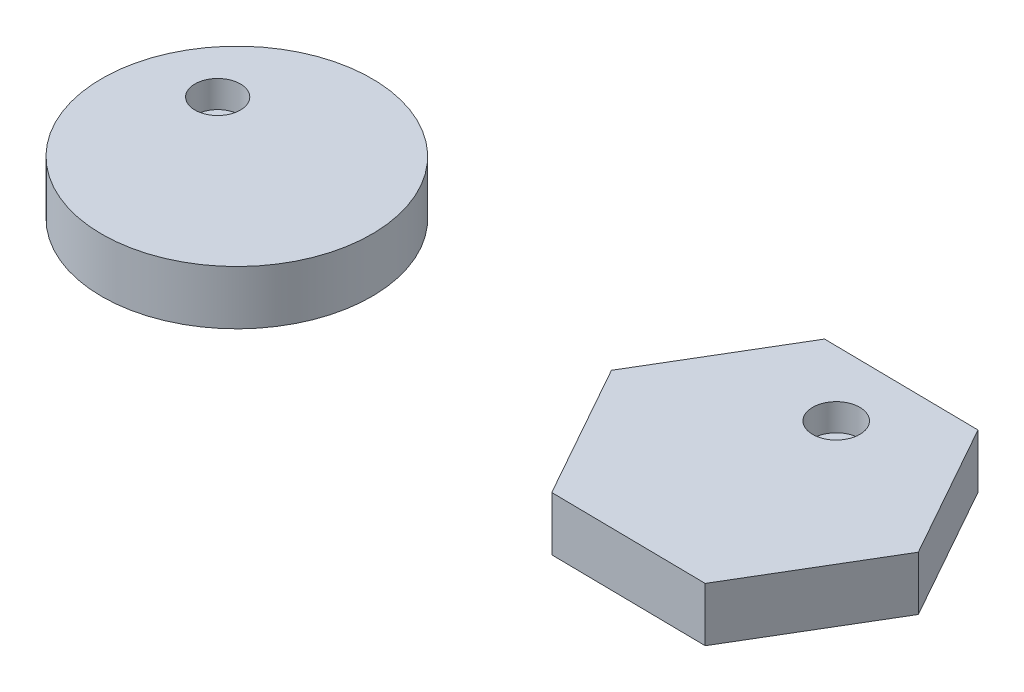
ISO-10303-21;
HEADER;
FILE_DESCRIPTION(('STEP AP214'),'2;1');
FILE_NAME('part.step','',(''),(''),'','','');
FILE_SCHEMA(('AUTOMOTIVE_DESIGN { 1 0 10303 214 1 1 1 1 }'));
ENDSEC;
DATA;
#1=APPLICATION_CONTEXT('core data for automotive mechanical design processes');
#2=APPLICATION_PROTOCOL_DEFINITION('international standard','automotive_design',2000,#1);
#3=PRODUCT_CONTEXT('',#1,'mechanical');
#4=PRODUCT('Part','Part','',(#3));
#5=PRODUCT_RELATED_PRODUCT_CATEGORY('part','',(#4));
#6=PRODUCT_DEFINITION_FORMATION('','',#4);
#7=PRODUCT_DEFINITION_CONTEXT('part definition',#1,'design');
#8=PRODUCT_DEFINITION('design','',#6,#7);
#9=PRODUCT_DEFINITION_SHAPE('','',#8);
#10=(LENGTH_UNIT() NAMED_UNIT(*) SI_UNIT(.MILLI.,.METRE.));
#11=(NAMED_UNIT(*) PLANE_ANGLE_UNIT() SI_UNIT($,.RADIAN.));
#12=(NAMED_UNIT(*) SI_UNIT($,.STERADIAN.) SOLID_ANGLE_UNIT());
#13=UNCERTAINTY_MEASURE_WITH_UNIT(LENGTH_MEASURE(1.E-05),#10,'distance_accuracy_value','');
#14=(GEOMETRIC_REPRESENTATION_CONTEXT(3) GLOBAL_UNCERTAINTY_ASSIGNED_CONTEXT((#13)) GLOBAL_UNIT_ASSIGNED_CONTEXT((#10,
#11,#12)) REPRESENTATION_CONTEXT('',''));
#15=CARTESIAN_POINT('',(0.,0.,0.));
#16=DIRECTION('',(0.,0.,1.));
#17=DIRECTION('',(1.,0.,0.));
#18=AXIS2_PLACEMENT_3D('',#15,#16,#17);
#19=CARTESIAN_POINT('',(321.63135187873,25.4,0.956410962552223));
#20=DIRECTION('',(-0.872487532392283,0.,0.488636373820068));
#21=DIRECTION('',(0.488636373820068,0.,0.872487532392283));
#22=AXIS2_PLACEMENT_3D('',#19,#20,#21);
#23=PLANE('',#22);
#24=DIRECTION('',(-0.488636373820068,0.,-0.872487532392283));
#25=VECTOR('',#24,1.);
#26=CARTESIAN_POINT('',(321.63135187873,0.,0.956410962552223));
#27=LINE('',#26,#25);
#28=CARTESIAN_POINT('',(321.63135187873,0.,0.956410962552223));
#29=VERTEX_POINT('',#28);
#30=CARTESIAN_POINT('',(285.881035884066,0.,-62.8777746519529));
#31=VERTEX_POINT('',#30);
#32=EDGE_CURVE('E123',#29,#31,#27,.T.);
#33=ORIENTED_EDGE('',*,*,#32,.T.);
#34=DIRECTION('',(0.,-1.,0.));
#35=VECTOR('',#34,1.);
#36=CARTESIAN_POINT('',(285.881035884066,25.4,-62.8777746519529));
#37=LINE('',#36,#35);
#38=CARTESIAN_POINT('',(285.881035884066,25.4,-62.8777746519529));
#39=VERTEX_POINT('',#38);
#40=EDGE_CURVE('E12',#39,#31,#37,.T.);
#41=ORIENTED_EDGE('',*,*,#40,.F.);
#42=DIRECTION('',(-0.488636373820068,0.,-0.872487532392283));
#43=VECTOR('',#42,1.);
#44=CARTESIAN_POINT('',(321.63135187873,25.4,0.956410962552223));
#45=LINE('',#44,#43);
#46=CARTESIAN_POINT('',(321.63135187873,25.4,0.956410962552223));
#47=VERTEX_POINT('',#46);
#48=EDGE_CURVE('E134',#47,#39,#45,.T.);
#49=ORIENTED_EDGE('',*,*,#48,.F.);
#50=DIRECTION('',(0.,-1.,0.));
#51=VECTOR('',#50,1.);
#52=CARTESIAN_POINT('',(321.63135187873,25.4,0.956410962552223));
#53=LINE('',#52,#51);
#54=EDGE_CURVE('E119',#47,#29,#53,.T.);
#55=ORIENTED_EDGE('',*,*,#54,.T.);
#56=EDGE_LOOP('',(#33,#41,#49,#55));
#57=FACE_BOUND('',#56,.T.);
#58=ADVANCED_FACE('F39',(#57),#23,.F.);
#59=CARTESIAN_POINT('',(285.881035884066,25.4,-62.8777746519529));
#60=DIRECTION('',(-0.0130722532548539,0.,0.999914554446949));
#61=DIRECTION('',(0.999914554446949,0.,0.0130722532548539));
#62=AXIS2_PLACEMENT_3D('',#59,#60,#61);
#63=PLANE('',#62);
#64=DIRECTION('',(-0.999914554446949,0.,-0.0130722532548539));
#65=VECTOR('',#64,1.);
#66=CARTESIAN_POINT('',(285.881035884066,0.,-62.8777746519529));
#67=LINE('',#66,#65);
#68=CARTESIAN_POINT('',(212.723851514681,0.,-63.8341856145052));
#69=VERTEX_POINT('',#68);
#70=EDGE_CURVE('E126',#31,#69,#67,.T.);
#71=ORIENTED_EDGE('',*,*,#70,.T.);
#72=DIRECTION('',(0.,-1.,0.));
#73=VECTOR('',#72,1.);
#74=CARTESIAN_POINT('',(212.723851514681,25.4,-63.8341856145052));
#75=LINE('',#74,#73);
#76=CARTESIAN_POINT('',(212.723851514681,25.4,-63.8341856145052));
#77=VERTEX_POINT('',#76);
#78=EDGE_CURVE('E47',#77,#69,#75,.T.);
#79=ORIENTED_EDGE('',*,*,#78,.F.);
#80=DIRECTION('',(-0.999914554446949,0.,-0.0130722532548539));
#81=VECTOR('',#80,1.);
#82=CARTESIAN_POINT('',(285.881035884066,25.4,-62.8777746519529));
#83=LINE('',#82,#81);
#84=EDGE_CURVE('E92',#39,#77,#83,.T.);
#85=ORIENTED_EDGE('',*,*,#84,.F.);
#86=ORIENTED_EDGE('',*,*,#40,.T.);
#87=EDGE_LOOP('',(#71,#79,#85,#86));
#88=FACE_BOUND('',#87,.T.);
#89=ADVANCED_FACE('F159',(#88),#63,.F.);
#90=CARTESIAN_POINT('',(212.723851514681,25.4,-63.8341856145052));
#91=DIRECTION('',(0.85941527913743,0.,0.511278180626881));
#92=DIRECTION('',(0.511278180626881,0.,-0.85941527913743));
#93=AXIS2_PLACEMENT_3D('',#90,#91,#92);
#94=PLANE('',#93);
#95=DIRECTION('',(-0.511278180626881,0.,0.85941527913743));
#96=VECTOR('',#95,1.);
#97=CARTESIAN_POINT('',(212.723851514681,0.,-63.8341856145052));
#98=LINE('',#97,#96);
#99=CARTESIAN_POINT('',(175.31698313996,0.,-0.956410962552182));
#100=VERTEX_POINT('',#99);
#101=EDGE_CURVE('E129',#69,#100,#98,.T.);
#102=ORIENTED_EDGE('',*,*,#101,.T.);
#103=DIRECTION('',(0.,-1.,0.));
#104=VECTOR('',#103,1.);
#105=CARTESIAN_POINT('',(175.31698313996,25.4,-0.956410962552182));
#106=LINE('',#105,#104);
#107=CARTESIAN_POINT('',(175.31698313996,25.4,-0.956410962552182));
#108=VERTEX_POINT('',#107);
#109=EDGE_CURVE('E114',#108,#100,#106,.T.);
#110=ORIENTED_EDGE('',*,*,#109,.F.);
#111=DIRECTION('',(-0.511278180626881,0.,0.85941527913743));
#112=VECTOR('',#111,1.);
#113=CARTESIAN_POINT('',(212.723851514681,25.4,-63.8341856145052));
#114=LINE('',#113,#112);
#115=EDGE_CURVE('E105',#77,#108,#114,.T.);
#116=ORIENTED_EDGE('',*,*,#115,.F.);
#117=ORIENTED_EDGE('',*,*,#78,.T.);
#118=EDGE_LOOP('',(#102,#110,#116,#117));
#119=FACE_BOUND('',#118,.T.);
#120=ADVANCED_FACE('F140',(#119),#94,.F.);
#121=CARTESIAN_POINT('',(175.31698313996,25.4,-0.956410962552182));
#122=DIRECTION('',(0.872487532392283,0.,-0.488636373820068));
#123=DIRECTION('',(-0.488636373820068,0.,-0.872487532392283));
#124=AXIS2_PLACEMENT_3D('',#121,#122,#123);
#125=PLANE('',#124);
#126=DIRECTION('',(0.488636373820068,0.,0.872487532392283));
#127=VECTOR('',#126,1.);
#128=CARTESIAN_POINT('',(175.31698313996,0.,-0.956410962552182));
#129=LINE('',#128,#127);
#130=CARTESIAN_POINT('',(211.067299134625,0.,62.877774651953));
#131=VERTEX_POINT('',#130);
#132=EDGE_CURVE('E113',#100,#131,#129,.T.);
#133=ORIENTED_EDGE('',*,*,#132,.T.);
#134=DIRECTION('',(0.,-1.,0.));
#135=VECTOR('',#134,1.);
#136=CARTESIAN_POINT('',(211.067299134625,25.4,62.877774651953));
#137=LINE('',#136,#135);
#138=CARTESIAN_POINT('',(211.067299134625,25.4,62.877774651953));
#139=VERTEX_POINT('',#138);
#140=EDGE_CURVE('E110',#139,#131,#137,.T.);
#141=ORIENTED_EDGE('',*,*,#140,.F.);
#142=DIRECTION('',(0.488636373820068,0.,0.872487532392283));
#143=VECTOR('',#142,1.);
#144=CARTESIAN_POINT('',(175.31698313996,25.4,-0.956410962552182));
#145=LINE('',#144,#143);
#146=EDGE_CURVE('E99',#108,#139,#145,.T.);
#147=ORIENTED_EDGE('',*,*,#146,.F.);
#148=ORIENTED_EDGE('',*,*,#109,.T.);
#149=EDGE_LOOP('',(#133,#141,#147,#148));
#150=FACE_BOUND('',#149,.T.);
#151=ADVANCED_FACE('F111',(#150),#125,.F.);
#152=CARTESIAN_POINT('',(211.067299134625,25.4,62.877774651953));
#153=DIRECTION('',(0.0130722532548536,0.,-0.999914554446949));
#154=DIRECTION('',(-0.999914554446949,0.,-0.0130722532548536));
#155=AXIS2_PLACEMENT_3D('',#152,#153,#154);
#156=PLANE('',#155);
#157=DIRECTION('',(0.999914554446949,0.,0.0130722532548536));
#158=VECTOR('',#157,1.);
#159=CARTESIAN_POINT('',(211.067299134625,0.,62.877774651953));
#160=LINE('',#159,#158);
#161=CARTESIAN_POINT('',(284.224483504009,0.,63.8341856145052));
#162=VERTEX_POINT('',#161);
#163=EDGE_CURVE('E78',#131,#162,#160,.T.);
#164=ORIENTED_EDGE('',*,*,#163,.T.);
#165=DIRECTION('',(0.,-1.,0.));
#166=VECTOR('',#165,1.);
#167=CARTESIAN_POINT('',(284.224483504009,25.4,63.8341856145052));
#168=LINE('',#167,#166);
#169=CARTESIAN_POINT('',(284.224483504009,25.4,63.8341856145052));
#170=VERTEX_POINT('',#169);
#171=EDGE_CURVE('E115',#170,#162,#168,.T.);
#172=ORIENTED_EDGE('',*,*,#171,.F.);
#173=DIRECTION('',(0.999914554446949,0.,0.0130722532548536));
#174=VECTOR('',#173,1.);
#175=CARTESIAN_POINT('',(211.067299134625,25.4,62.877774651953));
#176=LINE('',#175,#174);
#177=EDGE_CURVE('E103',#139,#170,#176,.T.);
#178=ORIENTED_EDGE('',*,*,#177,.F.);
#179=ORIENTED_EDGE('',*,*,#140,.T.);
#180=EDGE_LOOP('',(#164,#172,#178,#179));
#181=FACE_BOUND('',#180,.T.);
#182=ADVANCED_FACE('F117',(#181),#156,.F.);
#183=CARTESIAN_POINT('',(284.224483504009,25.4,63.8341856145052));
#184=DIRECTION('',(-0.85941527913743,0.,-0.511278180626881));
#185=DIRECTION('',(-0.511278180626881,0.,0.85941527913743));
#186=AXIS2_PLACEMENT_3D('',#183,#184,#185);
#187=PLANE('',#186);
#188=DIRECTION('',(0.511278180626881,0.,-0.85941527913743));
#189=VECTOR('',#188,1.);
#190=CARTESIAN_POINT('',(284.224483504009,0.,63.8341856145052));
#191=LINE('',#190,#189);
#192=EDGE_CURVE('E84',#162,#29,#191,.T.);
#193=ORIENTED_EDGE('',*,*,#192,.T.);
#194=ORIENTED_EDGE('',*,*,#54,.F.);
#195=DIRECTION('',(0.511278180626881,0.,-0.85941527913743));
#196=VECTOR('',#195,1.);
#197=CARTESIAN_POINT('',(284.224483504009,25.4,63.8341856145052));
#198=LINE('',#197,#196);
#199=EDGE_CURVE('E55',#170,#47,#198,.T.);
#200=ORIENTED_EDGE('',*,*,#199,.F.);
#201=ORIENTED_EDGE('',*,*,#171,.T.);
#202=EDGE_LOOP('',(#193,#194,#200,#201));
#203=FACE_BOUND('',#202,.T.);
#204=ADVANCED_FACE('F147',(#203),#187,.F.);
#205=CARTESIAN_POINT('',(285.881035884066,25.4,-62.8777746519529));
#206=DIRECTION('',(0.,1.,0.));
#207=DIRECTION('',(0.,0.,1.));
#208=AXIS2_PLACEMENT_3D('',#205,#206,#207);
#209=PLANE('',#208);
#210=CARTESIAN_POINT('',(248.8073716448,25.4,-33.2379084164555));
#211=DIRECTION('',(0.,1.,0.));
#212=DIRECTION('',(0.,0.,1.));
#213=AXIS2_PLACEMENT_3D('',#210,#211,#212);
#214=CIRCLE('',#213,11.0793028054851);
#215=CARTESIAN_POINT('',(248.8073716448,25.4,-22.1586056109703));
#216=VERTEX_POINT('',#215);
#217=EDGE_CURVE('E220',#216,#216,#214,.T.);
#218=ORIENTED_EDGE('',*,*,#217,.F.);
#219=EDGE_LOOP('',(#218));
#220=FACE_BOUND('',#219,.T.);
#221=ORIENTED_EDGE('',*,*,#48,.T.);
#222=ORIENTED_EDGE('',*,*,#84,.T.);
#223=ORIENTED_EDGE('',*,*,#115,.T.);
#224=ORIENTED_EDGE('',*,*,#146,.T.);
#225=ORIENTED_EDGE('',*,*,#177,.T.);
#226=ORIENTED_EDGE('',*,*,#199,.T.);
#227=EDGE_LOOP('',(#221,#222,#223,#224,#225,#226));
#228=FACE_BOUND('',#227,.T.);
#229=ADVANCED_FACE('F101',(#220,#228),#209,.T.);
#230=CARTESIAN_POINT('',(285.881035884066,0.,-62.8777746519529));
#231=DIRECTION('',(0.,1.,0.));
#232=DIRECTION('',(0.,0.,1.));
#233=AXIS2_PLACEMENT_3D('',#230,#231,#232);
#234=PLANE('',#233);
#235=ORIENTED_EDGE('',*,*,#32,.F.);
#236=ORIENTED_EDGE('',*,*,#192,.F.);
#237=ORIENTED_EDGE('',*,*,#163,.F.);
#238=ORIENTED_EDGE('',*,*,#132,.F.);
#239=ORIENTED_EDGE('',*,*,#101,.F.);
#240=ORIENTED_EDGE('',*,*,#70,.F.);
#241=EDGE_LOOP('',(#235,#236,#237,#238,#239,#240));
#242=FACE_BOUND('',#241,.T.);
#243=ADVANCED_FACE('F143',(#242),#234,.F.);
#244=CARTESIAN_POINT('',(248.8073716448,12.7,-33.2379084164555));
#245=DIRECTION('',(0.,1.,0.));
#246=DIRECTION('',(0.,0.,1.));
#247=AXIS2_PLACEMENT_3D('',#244,#245,#246);
#248=CYLINDRICAL_SURFACE('',#247,11.0793028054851);
#249=CARTESIAN_POINT('',(248.8073716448,12.7,-33.2379084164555));
#250=DIRECTION('',(0.,1.,0.));
#251=DIRECTION('',(0.,0.,1.));
#252=AXIS2_PLACEMENT_3D('',#249,#250,#251);
#253=CIRCLE('',#252,11.0793028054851);
#254=CARTESIAN_POINT('',(248.8073716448,12.7,-22.1586056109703));
#255=VERTEX_POINT('',#254);
#256=EDGE_CURVE('E127',#255,#255,#253,.T.);
#257=ORIENTED_EDGE('',*,*,#256,.F.);
#258=EDGE_LOOP('',(#257));
#259=FACE_BOUND('',#258,.T.);
#260=ORIENTED_EDGE('',*,*,#217,.T.);
#261=EDGE_LOOP('',(#260));
#262=FACE_BOUND('',#261,.T.);
#263=ADVANCED_FACE('F191',(#259,#262),#248,.F.);
#264=CARTESIAN_POINT('',(248.8073716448,12.7,-33.2379084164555));
#265=DIRECTION('',(0.,1.,0.));
#266=DIRECTION('',(0.,0.,1.));
#267=AXIS2_PLACEMENT_3D('',#264,#265,#266);
#268=PLANE('',#267);
#269=ORIENTED_EDGE('',*,*,#256,.T.);
#270=EDGE_LOOP('',(#269));
#271=FACE_BOUND('',#270,.T.);
#272=ADVANCED_FACE('F204',(#271),#268,.T.);
#273=CLOSED_SHELL('',(#58,#89,#120,#151,#182,#204,#229,#243,#263,#272));
#274=MANIFOLD_SOLID_BREP('B2',#273);
#275=CARTESIAN_POINT('',(0.,25.4,0.));
#276=DIRECTION('',(0.,-1.,0.));
#277=DIRECTION('',(0.,0.,-1.));
#278=AXIS2_PLACEMENT_3D('',#275,#276,#277);
#279=CYLINDRICAL_SURFACE('',#278,63.5);
#280=CARTESIAN_POINT('',(0.,25.4,0.));
#281=DIRECTION('',(0.,1.,0.));
#282=DIRECTION('',(0.,0.,1.));
#283=AXIS2_PLACEMENT_3D('',#280,#281,#282);
#284=CIRCLE('',#283,63.5);
#285=CARTESIAN_POINT('',(0.,25.4,63.5));
#286=VERTEX_POINT('',#285);
#287=EDGE_CURVE('E38',#286,#286,#284,.T.);
#288=ORIENTED_EDGE('',*,*,#287,.F.);
#289=EDGE_LOOP('',(#288));
#290=FACE_BOUND('',#289,.T.);
#291=CARTESIAN_POINT('',(0.,0.,0.));
#292=DIRECTION('',(0.,1.,0.));
#293=DIRECTION('',(0.,0.,1.));
#294=AXIS2_PLACEMENT_3D('',#291,#292,#293);
#295=CIRCLE('',#294,63.5);
#296=CARTESIAN_POINT('',(0.,0.,63.5));
#297=VERTEX_POINT('',#296);
#298=EDGE_CURVE('E248',#297,#297,#295,.T.);
#299=ORIENTED_EDGE('',*,*,#298,.T.);
#300=EDGE_LOOP('',(#299));
#301=FACE_BOUND('',#300,.T.);
#302=ADVANCED_FACE('F245',(#290,#301),#279,.T.);
#303=CARTESIAN_POINT('',(0.,25.4,0.));
#304=DIRECTION('',(0.,1.,0.));
#305=DIRECTION('',(0.,0.,1.));
#306=AXIS2_PLACEMENT_3D('',#303,#304,#305);
#307=PLANE('',#306);
#308=CARTESIAN_POINT('',(-28.6963051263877,25.4,-19.6890856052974));
#309=DIRECTION('',(0.,1.,0.));
#310=DIRECTION('',(0.,0.,1.));
#311=AXIS2_PLACEMENT_3D('',#308,#309,#310);
#312=CIRCLE('',#311,10.6874942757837);
#313=CARTESIAN_POINT('',(-28.6963051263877,25.4,-9.00159132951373));
#314=VERTEX_POINT('',#313);
#315=EDGE_CURVE('E257',#314,#314,#312,.T.);
#316=ORIENTED_EDGE('',*,*,#315,.F.);
#317=EDGE_LOOP('',(#316));
#318=FACE_BOUND('',#317,.T.);
#319=ORIENTED_EDGE('',*,*,#287,.T.);
#320=EDGE_LOOP('',(#319));
#321=FACE_BOUND('',#320,.T.);
#322=ADVANCED_FACE('F272',(#318,#321),#307,.T.);
#323=CARTESIAN_POINT('',(0.,0.,0.));
#324=DIRECTION('',(0.,1.,0.));
#325=DIRECTION('',(0.,0.,1.));
#326=AXIS2_PLACEMENT_3D('',#323,#324,#325);
#327=PLANE('',#326);
#328=ORIENTED_EDGE('',*,*,#298,.F.);
#329=EDGE_LOOP('',(#328));
#330=FACE_BOUND('',#329,.T.);
#331=ADVANCED_FACE('F268',(#330),#327,.F.);
#332=CARTESIAN_POINT('',(-28.6963051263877,12.7,-19.6890856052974));
#333=DIRECTION('',(0.,1.,0.));
#334=DIRECTION('',(0.,0.,1.));
#335=AXIS2_PLACEMENT_3D('',#332,#333,#334);
#336=CYLINDRICAL_SURFACE('',#335,10.6874942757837);
#337=CARTESIAN_POINT('',(-28.6963051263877,12.7,-19.6890856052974));
#338=DIRECTION('',(0.,1.,0.));
#339=DIRECTION('',(0.,0.,1.));
#340=AXIS2_PLACEMENT_3D('',#337,#338,#339);
#341=CIRCLE('',#340,10.6874942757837);
#342=CARTESIAN_POINT('',(-28.6963051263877,12.7,-9.00159132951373));
#343=VERTEX_POINT('',#342);
#344=EDGE_CURVE('E255',#343,#343,#341,.T.);
#345=ORIENTED_EDGE('',*,*,#344,.F.);
#346=EDGE_LOOP('',(#345));
#347=FACE_BOUND('',#346,.T.);
#348=ORIENTED_EDGE('',*,*,#315,.T.);
#349=EDGE_LOOP('',(#348));
#350=FACE_BOUND('',#349,.T.);
#351=ADVANCED_FACE('F265',(#347,#350),#336,.F.);
#352=CARTESIAN_POINT('',(-28.6963051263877,12.7,-19.6890856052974));
#353=DIRECTION('',(0.,1.,0.));
#354=DIRECTION('',(0.,0.,1.));
#355=AXIS2_PLACEMENT_3D('',#352,#353,#354);
#356=PLANE('',#355);
#357=ORIENTED_EDGE('',*,*,#344,.T.);
#358=EDGE_LOOP('',(#357));
#359=FACE_BOUND('',#358,.T.);
#360=ADVANCED_FACE('F263',(#359),#356,.T.);
#361=CLOSED_SHELL('',(#302,#322,#331,#351,#360));
#362=MANIFOLD_SOLID_BREP('B6',#361);
#363=ADVANCED_BREP_SHAPE_REPRESENTATION('',(#18,#274,#362),#14);
#364=SHAPE_DEFINITION_REPRESENTATION(#9,#363);
ENDSEC;
END-ISO-10303-21;
